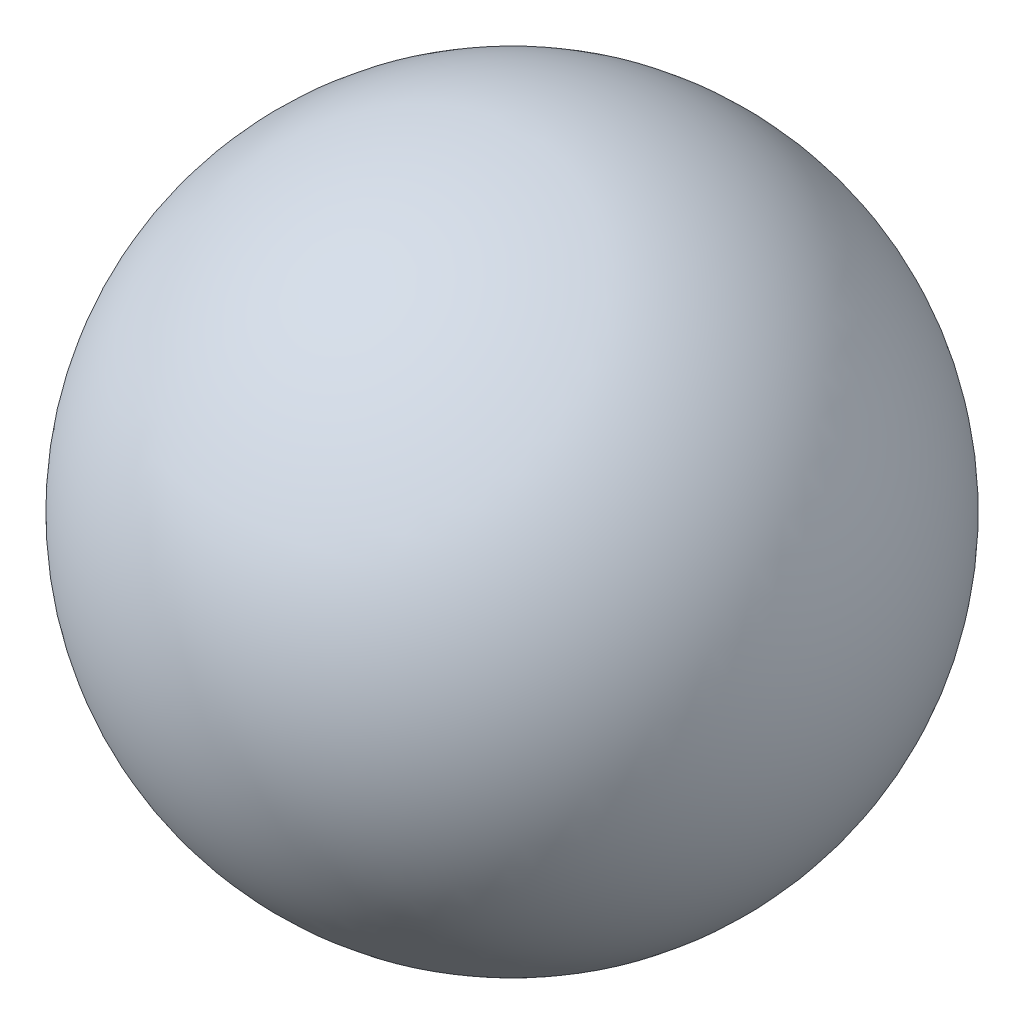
from build123d import *


with BuildPart() as part:
    # Esquisse1 → Base-R_volution (revolve)
    with BuildSketch(Plane(origin=(0, 0, 0), x_dir=(0, 0, -1), z_dir=(1, 0, 0))):
        with BuildLine():
            Line((0, 2.25), (0, -2.25))
            ThreePointArc((0, -2.25), (-2.25, 0), (0, 2.25))
        make_face()
    revolve(axis=Axis((0, 2.25, 0), (0, 1, 0)))


solid = part.part
